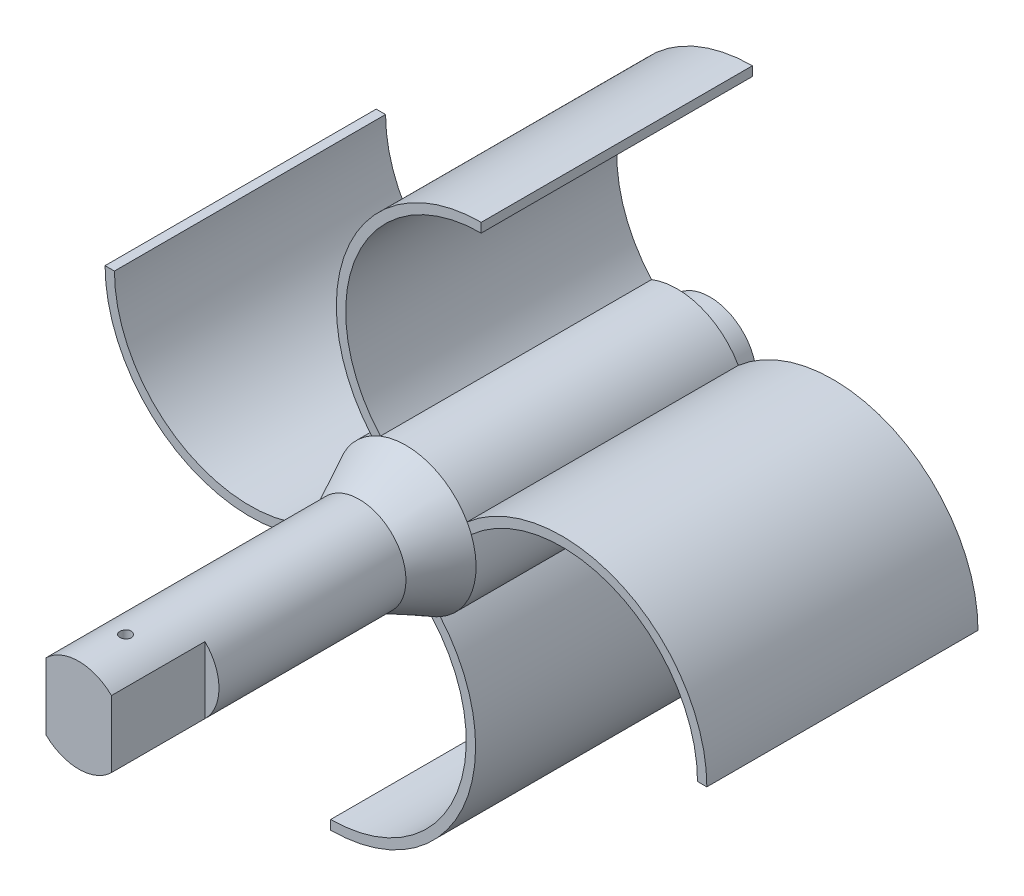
ISO-10303-21;
HEADER;
FILE_DESCRIPTION(('STEP AP214'),'2;1');
FILE_NAME('part.step','',(''),(''),'','','');
FILE_SCHEMA(('AUTOMOTIVE_DESIGN { 1 0 10303 214 1 1 1 1 }'));
ENDSEC;
DATA;
#1=APPLICATION_CONTEXT('core data for automotive mechanical design processes');
#2=APPLICATION_PROTOCOL_DEFINITION('international standard','automotive_design',2000,#1);
#3=PRODUCT_CONTEXT('',#1,'mechanical');
#4=PRODUCT('Part','Part','',(#3));
#5=PRODUCT_RELATED_PRODUCT_CATEGORY('part','',(#4));
#6=PRODUCT_DEFINITION_FORMATION('','',#4);
#7=PRODUCT_DEFINITION_CONTEXT('part definition',#1,'design');
#8=PRODUCT_DEFINITION('design','',#6,#7);
#9=PRODUCT_DEFINITION_SHAPE('','',#8);
#10=(LENGTH_UNIT() NAMED_UNIT(*) SI_UNIT(.MILLI.,.METRE.));
#11=(NAMED_UNIT(*) PLANE_ANGLE_UNIT() SI_UNIT($,.RADIAN.));
#12=(NAMED_UNIT(*) SI_UNIT($,.STERADIAN.) SOLID_ANGLE_UNIT());
#13=UNCERTAINTY_MEASURE_WITH_UNIT(LENGTH_MEASURE(1.E-05),#10,'distance_accuracy_value','');
#14=(GEOMETRIC_REPRESENTATION_CONTEXT(3) GLOBAL_UNCERTAINTY_ASSIGNED_CONTEXT((#13)) GLOBAL_UNIT_ASSIGNED_CONTEXT((#10,
#11,#12)) REPRESENTATION_CONTEXT('',''));
#15=CARTESIAN_POINT('',(0.,0.,0.));
#16=DIRECTION('',(0.,0.,1.));
#17=DIRECTION('',(1.,0.,0.));
#18=AXIS2_PLACEMENT_3D('',#15,#16,#17);
#19=CARTESIAN_POINT('',(0.,0.,128.));
#20=DIRECTION('',(0.,0.,-1.));
#21=DIRECTION('',(-1.,0.,0.));
#22=AXIS2_PLACEMENT_3D('',#19,#20,#21);
#23=CYLINDRICAL_SURFACE('',#22,10.);
#24=CARTESIAN_POINT('',(0.,10.,119.2));
#25=CARTESIAN_POINT('',(-0.0671456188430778,9.99999909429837,119.199997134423));
#26=CARTESIAN_POINT('',(-0.134333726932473,9.99931656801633,119.194345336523));
#27=CARTESIAN_POINT('',(-0.266841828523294,9.99665948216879,119.171887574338));
#28=CARTESIAN_POINT('',(-0.332159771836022,9.99468355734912,119.1550698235));
#29=CARTESIAN_POINT('',(-0.458989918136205,9.98966237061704,119.11078148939));
#30=CARTESIAN_POINT('',(-0.520504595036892,9.98661781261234,119.08331791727));
#31=CARTESIAN_POINT('',(-0.63803966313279,9.97979837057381,119.018532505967));
#32=CARTESIAN_POINT('',(-0.694061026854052,9.97602361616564,118.981212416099));
#33=CARTESIAN_POINT('',(-0.799316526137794,9.96814404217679,118.89757005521));
#34=CARTESIAN_POINT('',(-0.848518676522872,9.96403780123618,118.851207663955));
#35=CARTESIAN_POINT('',(-0.938463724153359,9.95596957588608,118.750882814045));
#36=CARTESIAN_POINT('',(-0.979206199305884,9.95200759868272,118.696919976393));
#37=CARTESIAN_POINT('',(-1.05119337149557,9.94466241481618,118.582719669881));
#38=CARTESIAN_POINT('',(-1.08240830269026,9.94128103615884,118.522463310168));
#39=CARTESIAN_POINT('',(-1.13426422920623,9.93549845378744,118.397516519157));
#40=CARTESIAN_POINT('',(-1.15490559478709,9.93309721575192,118.332826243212));
#41=CARTESIAN_POINT('',(-1.18493172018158,9.9295602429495,118.201178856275));
#42=CARTESIAN_POINT('',(-1.19437031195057,9.9284184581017,118.134234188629));
#43=CARTESIAN_POINT('',(-1.20188950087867,9.92751110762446,117.999702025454));
#44=CARTESIAN_POINT('',(-1.19997052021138,9.9277454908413,117.932114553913));
#45=CARTESIAN_POINT('',(-1.18487326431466,9.92955845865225,117.798589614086));
#46=CARTESIAN_POINT('',(-1.1717541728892,9.93112997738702,117.732645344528));
#47=CARTESIAN_POINT('',(-1.13472138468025,9.9354291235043,117.603901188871));
#48=CARTESIAN_POINT('',(-1.11080748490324,9.9381567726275,117.541101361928));
#49=CARTESIAN_POINT('',(-1.05279992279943,9.94446888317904,117.420244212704));
#50=CARTESIAN_POINT('',(-1.01868042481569,9.94805551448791,117.362199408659));
#51=CARTESIAN_POINT('',(-0.94124869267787,9.95567975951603,117.252637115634));
#52=CARTESIAN_POINT('',(-0.897936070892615,9.95971739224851,117.201119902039));
#53=CARTESIAN_POINT('',(-0.803019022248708,9.96782013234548,117.105731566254));
#54=CARTESIAN_POINT('',(-0.751363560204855,9.9718852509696,117.061911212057));
#55=CARTESIAN_POINT('',(-0.641403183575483,9.97956083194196,116.9835553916));
#56=CARTESIAN_POINT('',(-0.583098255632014,9.98317129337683,116.949019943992));
#57=CARTESIAN_POINT('',(-0.461455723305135,9.98953275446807,116.890214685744));
#58=CARTESIAN_POINT('',(-0.398116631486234,9.99228349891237,116.865947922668));
#59=CARTESIAN_POINT('',(-0.268222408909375,9.9966132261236,116.82840850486));
#60=CARTESIAN_POINT('',(-0.201667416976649,9.99819225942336,116.815135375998));
#61=CARTESIAN_POINT('',(-0.0676697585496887,9.99999410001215,116.800025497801));
#62=CARTESIAN_POINT('',(-0.000235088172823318,10.0002252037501,116.79811878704));
#63=CARTESIAN_POINT('',(0.1339928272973,9.99932751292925,116.805611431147));
#64=CARTESIAN_POINT('',(0.200786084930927,9.9981987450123,116.815010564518));
#65=CARTESIAN_POINT('',(0.331629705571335,9.99471333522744,116.844789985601));
#66=CARTESIAN_POINT('',(0.395687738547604,9.99236040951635,116.86513704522));
#67=CARTESIAN_POINT('',(0.519482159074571,9.9866902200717,116.916200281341));
#68=CARTESIAN_POINT('',(0.579218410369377,9.98337292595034,116.946916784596));
#69=CARTESIAN_POINT('',(0.692986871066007,9.97612340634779,117.018017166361));
#70=CARTESIAN_POINT('',(0.746990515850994,9.97218832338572,117.058446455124));
#71=CARTESIAN_POINT('',(0.847470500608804,9.96415271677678,117.147760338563));
#72=CARTESIAN_POINT('',(0.893946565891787,9.96005218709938,117.196645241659));
#73=CARTESIAN_POINT('',(0.978299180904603,9.95212237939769,117.301790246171));
#74=CARTESIAN_POINT('',(1.01612945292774,9.94829463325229,117.358087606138));
#75=CARTESIAN_POINT('',(1.08179725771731,9.94136859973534,117.47627801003));
#76=CARTESIAN_POINT('',(1.10963497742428,9.9382702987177,117.538170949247));
#77=CARTESIAN_POINT('',(1.15445198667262,9.9331642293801,117.665644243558));
#78=CARTESIAN_POINT('',(1.17145768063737,9.93115381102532,117.731215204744));
#79=CARTESIAN_POINT('',(1.19421308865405,9.92844341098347,117.864307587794));
#80=CARTESIAN_POINT('',(1.19996328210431,9.92774337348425,117.931828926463));
#81=CARTESIAN_POINT('',(1.20003613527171,9.92773453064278,118.066445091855));
#82=CARTESIAN_POINT('',(1.19443149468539,9.92841687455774,118.133539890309));
#83=CARTESIAN_POINT('',(1.17210739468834,9.93107691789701,118.265826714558));
#84=CARTESIAN_POINT('',(1.15538793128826,9.93305461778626,118.33101873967));
#85=CARTESIAN_POINT('',(1.11133095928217,9.93807986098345,118.457641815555));
#86=CARTESIAN_POINT('',(1.08399666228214,9.9411270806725,118.519073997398));
#87=CARTESIAN_POINT('',(1.01949313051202,9.94794858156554,118.636491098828));
#88=CARTESIAN_POINT('',(0.98232381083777,9.95172286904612,118.692475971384));
#89=CARTESIAN_POINT('',(0.898934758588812,9.9596022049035,118.797781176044));
#90=CARTESIAN_POINT('',(0.85266081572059,9.96370914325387,118.847058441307));
#91=CARTESIAN_POINT('',(0.752488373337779,9.97177419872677,118.937176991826));
#92=CARTESIAN_POINT('',(0.698588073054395,9.9757322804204,118.978016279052));
#93=CARTESIAN_POINT('',(0.58447728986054,9.98306886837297,119.0502202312));
#94=CARTESIAN_POINT('',(0.524245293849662,9.98644528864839,119.081551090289));
#95=CARTESIAN_POINT('',(0.399369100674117,9.99221674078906,119.133609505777));
#96=CARTESIAN_POINT('',(0.33472982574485,9.9946128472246,119.154348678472));
#97=CARTESIAN_POINT('',(0.224790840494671,9.99757073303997,119.179625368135));
#98=CARTESIAN_POINT('',(0.180186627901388,9.99847731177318,119.187254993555));
#99=CARTESIAN_POINT('',(0.0903946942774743,9.99969224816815,119.197443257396));
#100=CARTESIAN_POINT('',(0.0452069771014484,10.0000006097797,119.2000019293));
#101=CARTESIAN_POINT('',(0.,10.,119.2));
#102=B_SPLINE_CURVE_WITH_KNOTS('',3,(#24,#25,#26,#27,#28,#29,#30,#31,#32,#33,#34,#35,#36,#37,
#38,#39,#40,#41,#42,#43,#44,#45,#46,#47,#48,#49,#50,#51,#52,#53,#54,#55,#56,#57,#58,#59,#60,#61,
#62,#63,#64,#65,#66,#67,#68,#69,#70,#71,#72,#73,#74,#75,#76,#77,#78,#79,#80,#81,#82,#83,#84,#85,
#86,#87,#88,#89,#90,#91,#92,#93,#94,#95,#96,#97,#98,#99,#100,#101),.UNSPECIFIED.,.T.,.F.,(4,2,2,
2,2,2,2,2,2,2,2,2,2,2,2,2,2,2,2,2,2,2,2,2,2,2,2,2,2,2,2,2,2,2,2,2,2,2,4),(0.,0.201271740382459,
0.402756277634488,0.604108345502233,0.805424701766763,1.0076554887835,1.20989636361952,
1.41276275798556,1.61562204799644,1.81750255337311,2.0193755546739,2.22018837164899,
2.42100496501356,2.62233429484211,2.82367211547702,3.02629177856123,3.22891184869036,
3.43159201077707,3.63426343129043,3.83568609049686,4.03710480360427,4.23791561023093,
4.43873274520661,4.6405076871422,4.84228999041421,5.04512830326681,5.24796282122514,
5.45030099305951,5.65263054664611,5.8536687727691,6.05470707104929,6.25568459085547,
6.45666384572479,6.65887809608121,6.86114017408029,7.06411316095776,7.26686305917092,
7.40237371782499,7.53788348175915),.UNSPECIFIED.);
#103=CARTESIAN_POINT('',(0.,10.,119.2));
#104=VERTEX_POINT('',#103);
#105=EDGE_CURVE('E13',#104,#104,#102,.T.);
#106=ORIENTED_EDGE('',*,*,#105,.T.);
#107=EDGE_LOOP('',(#106));
#108=FACE_BOUND('',#107,.T.);
#109=CARTESIAN_POINT('',(0.,-10.,119.2));
#110=CARTESIAN_POINT('',(0.0671456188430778,-9.99999909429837,119.199997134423));
#111=CARTESIAN_POINT('',(0.134333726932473,-9.99931656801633,119.194345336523));
#112=CARTESIAN_POINT('',(0.266841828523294,-9.99665948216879,119.171887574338));
#113=CARTESIAN_POINT('',(0.332159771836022,-9.99468355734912,119.1550698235));
#114=CARTESIAN_POINT('',(0.458989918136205,-9.98966237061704,119.11078148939));
#115=CARTESIAN_POINT('',(0.520504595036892,-9.98661781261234,119.08331791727));
#116=CARTESIAN_POINT('',(0.63803966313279,-9.97979837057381,119.018532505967));
#117=CARTESIAN_POINT('',(0.694061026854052,-9.97602361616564,118.981212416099));
#118=CARTESIAN_POINT('',(0.799316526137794,-9.96814404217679,118.89757005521));
#119=CARTESIAN_POINT('',(0.848518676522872,-9.96403780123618,118.851207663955));
#120=CARTESIAN_POINT('',(0.938463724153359,-9.95596957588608,118.750882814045));
#121=CARTESIAN_POINT('',(0.979206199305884,-9.95200759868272,118.696919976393));
#122=CARTESIAN_POINT('',(1.05119337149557,-9.94466241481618,118.582719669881));
#123=CARTESIAN_POINT('',(1.08240830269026,-9.94128103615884,118.522463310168));
#124=CARTESIAN_POINT('',(1.13426422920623,-9.93549845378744,118.397516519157));
#125=CARTESIAN_POINT('',(1.15490559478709,-9.93309721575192,118.332826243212));
#126=CARTESIAN_POINT('',(1.18493172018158,-9.9295602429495,118.201178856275));
#127=CARTESIAN_POINT('',(1.19437031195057,-9.9284184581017,118.134234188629));
#128=CARTESIAN_POINT('',(1.20188950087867,-9.92751110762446,117.999702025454));
#129=CARTESIAN_POINT('',(1.19997052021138,-9.9277454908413,117.932114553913));
#130=CARTESIAN_POINT('',(1.18487326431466,-9.92955845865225,117.798589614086));
#131=CARTESIAN_POINT('',(1.1717541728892,-9.93112997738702,117.732645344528));
#132=CARTESIAN_POINT('',(1.13472138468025,-9.9354291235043,117.603901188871));
#133=CARTESIAN_POINT('',(1.11080748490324,-9.9381567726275,117.541101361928));
#134=CARTESIAN_POINT('',(1.05279992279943,-9.94446888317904,117.420244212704));
#135=CARTESIAN_POINT('',(1.01868042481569,-9.94805551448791,117.362199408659));
#136=CARTESIAN_POINT('',(0.94124869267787,-9.95567975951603,117.252637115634));
#137=CARTESIAN_POINT('',(0.897936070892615,-9.95971739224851,117.201119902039));
#138=CARTESIAN_POINT('',(0.803019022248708,-9.96782013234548,117.105731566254));
#139=CARTESIAN_POINT('',(0.751363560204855,-9.9718852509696,117.061911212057));
#140=CARTESIAN_POINT('',(0.641403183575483,-9.97956083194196,116.9835553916));
#141=CARTESIAN_POINT('',(0.583098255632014,-9.98317129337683,116.949019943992));
#142=CARTESIAN_POINT('',(0.461455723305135,-9.98953275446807,116.890214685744));
#143=CARTESIAN_POINT('',(0.398116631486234,-9.99228349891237,116.865947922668));
#144=CARTESIAN_POINT('',(0.268222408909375,-9.9966132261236,116.82840850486));
#145=CARTESIAN_POINT('',(0.201667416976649,-9.99819225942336,116.815135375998));
#146=CARTESIAN_POINT('',(0.0676697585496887,-9.99999410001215,116.800025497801));
#147=CARTESIAN_POINT('',(0.000235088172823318,-10.0002252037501,116.79811878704));
#148=CARTESIAN_POINT('',(-0.1339928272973,-9.99932751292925,116.805611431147));
#149=CARTESIAN_POINT('',(-0.200786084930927,-9.9981987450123,116.815010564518));
#150=CARTESIAN_POINT('',(-0.331629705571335,-9.99471333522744,116.844789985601));
#151=CARTESIAN_POINT('',(-0.395687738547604,-9.99236040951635,116.86513704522));
#152=CARTESIAN_POINT('',(-0.519482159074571,-9.9866902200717,116.916200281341));
#153=CARTESIAN_POINT('',(-0.579218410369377,-9.98337292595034,116.946916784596));
#154=CARTESIAN_POINT('',(-0.692986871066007,-9.97612340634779,117.018017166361));
#155=CARTESIAN_POINT('',(-0.746990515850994,-9.97218832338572,117.058446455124));
#156=CARTESIAN_POINT('',(-0.847470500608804,-9.96415271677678,117.147760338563));
#157=CARTESIAN_POINT('',(-0.893946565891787,-9.96005218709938,117.196645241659));
#158=CARTESIAN_POINT('',(-0.978299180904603,-9.95212237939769,117.301790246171));
#159=CARTESIAN_POINT('',(-1.01612945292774,-9.94829463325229,117.358087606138));
#160=CARTESIAN_POINT('',(-1.08179725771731,-9.94136859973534,117.47627801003));
#161=CARTESIAN_POINT('',(-1.10963497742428,-9.9382702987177,117.538170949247));
#162=CARTESIAN_POINT('',(-1.15445198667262,-9.9331642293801,117.665644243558));
#163=CARTESIAN_POINT('',(-1.17145768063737,-9.93115381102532,117.731215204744));
#164=CARTESIAN_POINT('',(-1.19421308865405,-9.92844341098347,117.864307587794));
#165=CARTESIAN_POINT('',(-1.19996328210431,-9.92774337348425,117.931828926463));
#166=CARTESIAN_POINT('',(-1.20003613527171,-9.92773453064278,118.066445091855));
#167=CARTESIAN_POINT('',(-1.19443149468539,-9.92841687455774,118.133539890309));
#168=CARTESIAN_POINT('',(-1.17210739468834,-9.93107691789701,118.265826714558));
#169=CARTESIAN_POINT('',(-1.15538793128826,-9.93305461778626,118.33101873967));
#170=CARTESIAN_POINT('',(-1.11133095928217,-9.93807986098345,118.457641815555));
#171=CARTESIAN_POINT('',(-1.08399666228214,-9.9411270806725,118.519073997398));
#172=CARTESIAN_POINT('',(-1.01949313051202,-9.94794858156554,118.636491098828));
#173=CARTESIAN_POINT('',(-0.98232381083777,-9.95172286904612,118.692475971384));
#174=CARTESIAN_POINT('',(-0.898934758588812,-9.9596022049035,118.797781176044));
#175=CARTESIAN_POINT('',(-0.85266081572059,-9.96370914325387,118.847058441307));
#176=CARTESIAN_POINT('',(-0.752488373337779,-9.97177419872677,118.937176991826));
#177=CARTESIAN_POINT('',(-0.698588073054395,-9.9757322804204,118.978016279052));
#178=CARTESIAN_POINT('',(-0.58447728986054,-9.98306886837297,119.0502202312));
#179=CARTESIAN_POINT('',(-0.524245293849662,-9.98644528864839,119.081551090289));
#180=CARTESIAN_POINT('',(-0.399369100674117,-9.99221674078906,119.133609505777));
#181=CARTESIAN_POINT('',(-0.33472982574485,-9.9946128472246,119.154348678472));
#182=CARTESIAN_POINT('',(-0.224790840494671,-9.99757073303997,119.179625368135));
#183=CARTESIAN_POINT('',(-0.180186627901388,-9.99847731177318,119.187254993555));
#184=CARTESIAN_POINT('',(-0.0903946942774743,-9.99969224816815,119.197443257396));
#185=CARTESIAN_POINT('',(-0.0452069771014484,-10.0000006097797,119.2000019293));
#186=CARTESIAN_POINT('',(0.,-10.,119.2));
#187=B_SPLINE_CURVE_WITH_KNOTS('',3,(#109,#110,#111,#112,#113,#114,#115,#116,#117,#118,#119,
#120,#121,#122,#123,#124,#125,#126,#127,#128,#129,#130,#131,#132,#133,#134,#135,#136,#137,#138,
#139,#140,#141,#142,#143,#144,#145,#146,#147,#148,#149,#150,#151,#152,#153,#154,#155,#156,#157,
#158,#159,#160,#161,#162,#163,#164,#165,#166,#167,#168,#169,#170,#171,#172,#173,#174,#175,#176,
#177,#178,#179,#180,#181,#182,#183,#184,#185,#186),.UNSPECIFIED.,.T.,.F.,(4,2,2,2,2,2,2,2,2,2,2,
2,2,2,2,2,2,2,2,2,2,2,2,2,2,2,2,2,2,2,2,2,2,2,2,2,2,2,4),(0.,0.201271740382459,
0.402756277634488,0.604108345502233,0.805424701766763,1.0076554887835,1.20989636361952,
1.41276275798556,1.61562204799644,1.81750255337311,2.0193755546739,2.22018837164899,
2.42100496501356,2.62233429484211,2.82367211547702,3.02629177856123,3.22891184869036,
3.43159201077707,3.63426343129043,3.83568609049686,4.03710480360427,4.23791561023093,
4.43873274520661,4.6405076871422,4.84228999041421,5.04512830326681,5.24796282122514,
5.45030099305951,5.65263054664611,5.8536687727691,6.05470707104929,6.25568459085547,
6.45666384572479,6.65887809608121,6.86114017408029,7.06411316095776,7.26686305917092,
7.40237371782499,7.53788348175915),.UNSPECIFIED.);
#188=CARTESIAN_POINT('',(0.,-10.,119.2));
#189=VERTEX_POINT('',#188);
#190=EDGE_CURVE('E269',#189,#189,#187,.T.);
#191=ORIENTED_EDGE('',*,*,#190,.T.);
#192=EDGE_LOOP('',(#191));
#193=FACE_BOUND('',#192,.T.);
#194=CARTESIAN_POINT('',(0.,0.,68.));
#195=DIRECTION('',(0.,0.,1.));
#196=DIRECTION('',(1.,0.,0.));
#197=AXIS2_PLACEMENT_3D('',#194,#195,#196);
#198=CIRCLE('',#197,10.);
#199=CARTESIAN_POINT('',(10.,0.,68.));
#200=VERTEX_POINT('',#199);
#201=EDGE_CURVE('E195',#200,#200,#198,.T.);
#202=ORIENTED_EDGE('',*,*,#201,.T.);
#203=EDGE_LOOP('',(#202));
#204=FACE_BOUND('',#203,.T.);
#205=DIRECTION('',(0.,0.,-1.));
#206=VECTOR('',#205,1.);
#207=CARTESIAN_POINT('',(7.,-7.14142842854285,128.));
#208=LINE('',#207,#206);
#209=CARTESIAN_POINT('',(7.,-7.14142842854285,128.));
#210=VERTEX_POINT('',#209);
#211=CARTESIAN_POINT('',(7.,-7.14142842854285,108.));
#212=VERTEX_POINT('',#211);
#213=EDGE_CURVE('E201',#210,#212,#208,.T.);
#214=ORIENTED_EDGE('',*,*,#213,.F.);
#215=CARTESIAN_POINT('',(0.,0.,128.));
#216=DIRECTION('',(0.,0.,1.));
#217=DIRECTION('',(1.,0.,0.));
#218=AXIS2_PLACEMENT_3D('',#215,#216,#217);
#219=CIRCLE('',#218,10.);
#220=CARTESIAN_POINT('',(-7.,-7.14142842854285,128.));
#221=VERTEX_POINT('',#220);
#222=EDGE_CURVE('E196',#221,#210,#219,.T.);
#223=ORIENTED_EDGE('',*,*,#222,.F.);
#224=DIRECTION('',(0.,0.,-1.));
#225=VECTOR('',#224,1.);
#226=CARTESIAN_POINT('',(-7.,-7.14142842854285,128.));
#227=LINE('',#226,#225);
#228=CARTESIAN_POINT('',(-7.,-7.14142842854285,108.));
#229=VERTEX_POINT('',#228);
#230=EDGE_CURVE('E54',#229,#221,#227,.F.);
#231=ORIENTED_EDGE('',*,*,#230,.F.);
#232=CARTESIAN_POINT('',(0.,0.,108.));
#233=DIRECTION('',(0.,0.,1.));
#234=DIRECTION('',(1.,0.,0.));
#235=AXIS2_PLACEMENT_3D('',#232,#233,#234);
#236=CIRCLE('',#235,10.);
#237=CARTESIAN_POINT('',(-7.,7.14142842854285,108.));
#238=VERTEX_POINT('',#237);
#239=EDGE_CURVE('E192',#238,#229,#236,.T.);
#240=ORIENTED_EDGE('',*,*,#239,.F.);
#241=DIRECTION('',(0.,0.,-1.));
#242=VECTOR('',#241,1.);
#243=CARTESIAN_POINT('',(-7.,7.14142842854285,128.));
#244=LINE('',#243,#242);
#245=CARTESIAN_POINT('',(-7.,7.14142842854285,128.));
#246=VERTEX_POINT('',#245);
#247=EDGE_CURVE('E178',#246,#238,#244,.T.);
#248=ORIENTED_EDGE('',*,*,#247,.F.);
#249=CARTESIAN_POINT('',(7.,7.14142842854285,128.));
#250=VERTEX_POINT('',#249);
#251=EDGE_CURVE('E191',#250,#246,#219,.T.);
#252=ORIENTED_EDGE('',*,*,#251,.F.);
#253=DIRECTION('',(0.,0.,-1.));
#254=VECTOR('',#253,1.);
#255=CARTESIAN_POINT('',(7.,7.14142842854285,128.));
#256=LINE('',#255,#254);
#257=CARTESIAN_POINT('',(7.,7.14142842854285,108.));
#258=VERTEX_POINT('',#257);
#259=EDGE_CURVE('E62',#258,#250,#256,.F.);
#260=ORIENTED_EDGE('',*,*,#259,.F.);
#261=EDGE_CURVE('E47',#212,#258,#236,.T.);
#262=ORIENTED_EDGE('',*,*,#261,.F.);
#263=EDGE_LOOP('',(#214,#223,#231,#240,#248,#252,#260,#262));
#264=FACE_BOUND('',#263,.T.);
#265=ADVANCED_FACE('F34',(#108,#193,#204,#264),#23,.T.);
#266=CARTESIAN_POINT('',(0.,0.,128.));
#267=DIRECTION('',(0.,0.,1.));
#268=DIRECTION('',(1.,0.,0.));
#269=AXIS2_PLACEMENT_3D('',#266,#267,#268);
#270=PLANE('',#269);
#271=ORIENTED_EDGE('',*,*,#222,.T.);
#272=DIRECTION('',(0.,1.,0.));
#273=VECTOR('',#272,1.);
#274=CARTESIAN_POINT('',(7.,0.,128.));
#275=LINE('',#274,#273);
#276=EDGE_CURVE('E184',#210,#250,#275,.T.);
#277=ORIENTED_EDGE('',*,*,#276,.T.);
#278=ORIENTED_EDGE('',*,*,#251,.T.);
#279=DIRECTION('',(0.,-1.,0.));
#280=VECTOR('',#279,1.);
#281=CARTESIAN_POINT('',(-7.,0.,128.));
#282=LINE('',#281,#280);
#283=EDGE_CURVE('E175',#246,#221,#282,.T.);
#284=ORIENTED_EDGE('',*,*,#283,.T.);
#285=EDGE_LOOP('',(#271,#277,#278,#284));
#286=FACE_BOUND('',#285,.T.);
#287=ADVANCED_FACE('F194',(#286),#270,.T.);
#288=CARTESIAN_POINT('',(0.,0.,58.));
#289=DIRECTION('',(0.,0.,1.));
#290=DIRECTION('',(1.,0.,0.));
#291=AXIS2_PLACEMENT_3D('',#288,#289,#290);
#292=PLANE('',#291);
#293=CARTESIAN_POINT('',(-16.1026338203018,-33.3633349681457,58.));
#294=DIRECTION('',(0.,0.,1.));
#295=DIRECTION('',(1.,0.,0.));
#296=AXIS2_PLACEMENT_3D('',#293,#294,#295);
#297=CIRCLE('',#296,31.);
#298=CARTESIAN_POINT('',(-16.1026338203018,-64.3633349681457,58.));
#299=VERTEX_POINT('',#298);
#300=CARTESIAN_POINT('',(7.34126581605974,-13.0807421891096,58.));
#301=VERTEX_POINT('',#300);
#302=EDGE_CURVE('E614',#299,#301,#297,.T.);
#303=ORIENTED_EDGE('',*,*,#302,.T.);
#304=CARTESIAN_POINT('',(7.34126560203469,-13.0807418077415,58.));
#305=CARTESIAN_POINT('',(7.30340291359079,-13.1019906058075,58.));
#306=CARTESIAN_POINT('',(7.26544781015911,-13.1230749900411,58.));
#307=CARTESIAN_POINT('',(7.18933207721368,-13.1649274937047,58.));
#308=CARTESIAN_POINT('',(7.15117133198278,-13.1856954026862,58.));
#309=CARTESIAN_POINT('',(7.09894333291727,-13.2138270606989,58.));
#310=CARTESIAN_POINT('',(7.08495314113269,-13.2213341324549,58.));
#311=CARTESIAN_POINT('',(7.04668687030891,-13.2417894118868,58.));
#312=CARTESIAN_POINT('',(7.02238696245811,-13.2546930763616,58.));
#313=CARTESIAN_POINT('',(6.95969995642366,-13.287759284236,58.));
#314=CARTESIAN_POINT('',(6.92126021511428,-13.3078221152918,58.));
#315=CARTESIAN_POINT('',(6.84419099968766,-13.3476217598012,58.));
#316=CARTESIAN_POINT('',(6.80556144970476,-13.3673584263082,58.));
#317=CARTESIAN_POINT('',(6.72811256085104,-13.4065057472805,58.));
#318=CARTESIAN_POINT('',(6.68929313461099,-13.4259162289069,58.));
#319=CARTESIAN_POINT('',(6.61146446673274,-13.4644110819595,58.));
#320=CARTESIAN_POINT('',(6.5724551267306,-13.4834952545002,58.));
#321=CARTESIAN_POINT('',(6.49343637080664,-13.521730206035,58.));
#322=CARTESIAN_POINT('',(6.45342341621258,-13.5408736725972,58.));
#323=CARTESIAN_POINT('',(6.37495103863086,-13.5779907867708,58.));
#324=CARTESIAN_POINT('',(6.33649867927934,-13.5959793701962,58.));
#325=CARTESIAN_POINT('',(6.25861193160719,-13.6320121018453,58.));
#326=CARTESIAN_POINT('',(6.21917423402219,-13.6500490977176,58.));
#327=CARTESIAN_POINT('',(6.14012532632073,-13.6857882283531,58.));
#328=CARTESIAN_POINT('',(6.10051404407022,-13.703490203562,58.));
#329=CARTESIAN_POINT('',(6.02111792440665,-13.7385591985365,58.));
#330=CARTESIAN_POINT('',(5.98133300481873,-13.7559260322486,58.));
#331=CARTESIAN_POINT('',(5.90158957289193,-13.7903247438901,58.));
#332=CARTESIAN_POINT('',(5.86163096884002,-13.8073564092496,58.));
#333=CARTESIAN_POINT('',(5.79451671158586,-13.8356203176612,58.));
#334=CARTESIAN_POINT('',(5.76740057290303,-13.8469464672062,58.));
#335=CARTESIAN_POINT('',(5.72728303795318,-13.8635651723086,58.));
#336=CARTESIAN_POINT('',(5.71430707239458,-13.8689191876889,58.));
#337=CARTESIAN_POINT('',(5.66122310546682,-13.890734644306,58.));
#338=CARTESIAN_POINT('',(5.62105074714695,-13.9070398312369,58.));
#339=CARTESIAN_POINT('',(5.54054910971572,-13.9393071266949,58.));
#340=CARTESIAN_POINT('',(5.50021977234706,-13.9552690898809,58.));
#341=CARTESIAN_POINT('',(5.45982206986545,-13.9710556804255,58.));
#342=B_SPLINE_CURVE_WITH_KNOTS('',3,(#304,#305,#306,#307,#308,#309,#310,#311,#312,#313,#314,
#315,#316,#317,#318,#319,#320,#321,#322,#323,#324,#325,#326,#327,#328,#329,#330,#331,#332,#333,
#334,#335,#336,#337,#338,#339,#340,#341),.UNSPECIFIED.,.F.,.F.,(4,2,2,2,2,2,2,2,2,2,2,2,2,2,2,2,
2,2,4),(0.,0.130252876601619,0.260588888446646,0.308220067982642,0.390760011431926,
0.520839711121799,0.650976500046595,0.781180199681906,0.911460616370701,1.04452869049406,
1.17188319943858,1.30198146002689,1.43214019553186,1.56236922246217,1.69267834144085,
1.78083734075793,1.82294871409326,1.95301266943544,2.0831306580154),.UNSPECIFIED.);
#343=CARTESIAN_POINT('',(5.45982078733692,-13.9710542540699,58.));
#344=VERTEX_POINT('',#343);
#345=EDGE_CURVE('E185',#301,#344,#342,.T.);
#346=ORIENTED_EDGE('',*,*,#345,.T.);
#347=CARTESIAN_POINT('',(-16.1026338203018,-33.3633349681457,58.));
#348=DIRECTION('',(0.,0.,-1.));
#349=DIRECTION('',(1.,0.,0.));
#350=AXIS2_PLACEMENT_3D('',#347,#348,#349);
#351=CIRCLE('',#350,29.);
#352=CARTESIAN_POINT('',(-16.1026338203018,-62.3633349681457,58.));
#353=VERTEX_POINT('',#352);
#354=EDGE_CURVE('E632',#344,#353,#351,.T.);
#355=ORIENTED_EDGE('',*,*,#354,.T.);
#356=DIRECTION('',(0.,-1.,0.));
#357=VECTOR('',#356,1.);
#358=CARTESIAN_POINT('',(-16.1026338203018,-64.3633349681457,58.));
#359=LINE('',#358,#357);
#360=EDGE_CURVE('E617',#353,#299,#359,.T.);
#361=ORIENTED_EDGE('',*,*,#360,.T.);
#362=EDGE_LOOP('',(#303,#346,#355,#361));
#363=FACE_BOUND('',#362,.T.);
#364=ADVANCED_FACE('F290',(#363),#292,.T.);
#365=CARTESIAN_POINT('',(-33.3633349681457,16.1026338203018,58.));
#366=DIRECTION('',(0.,0.,1.));
#367=DIRECTION('',(1.,0.,0.));
#368=AXIS2_PLACEMENT_3D('',#365,#366,#367);
#369=CIRCLE('',#368,31.);
#370=CARTESIAN_POINT('',(-64.3633349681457,16.1026338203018,58.));
#371=VERTEX_POINT('',#370);
#372=CARTESIAN_POINT('',(-13.0807421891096,-7.34126581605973,58.));
#373=VERTEX_POINT('',#372);
#374=EDGE_CURVE('E587',#371,#373,#369,.T.);
#375=ORIENTED_EDGE('',*,*,#374,.T.);
#376=CARTESIAN_POINT('',(-13.0807418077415,-7.34126560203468,58.));
#377=CARTESIAN_POINT('',(-13.1019906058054,-7.30340291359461,58.));
#378=CARTESIAN_POINT('',(-13.1230749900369,-7.26544781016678,58.));
#379=CARTESIAN_POINT('',(-13.1649274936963,-7.18933207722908,58.));
#380=CARTESIAN_POINT('',(-13.1856954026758,-7.15117133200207,58.));
#381=CARTESIAN_POINT('',(-13.2138270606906,-7.09894333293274,58.));
#382=CARTESIAN_POINT('',(-13.2213341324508,-7.08495314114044,58.));
#383=CARTESIAN_POINT('',(-13.2417894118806,-7.0466868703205,58.));
#384=CARTESIAN_POINT('',(-13.2546930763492,-7.02238696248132,58.));
#385=CARTESIAN_POINT('',(-13.2877592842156,-6.95969995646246,58.));
#386=CARTESIAN_POINT('',(-13.3078221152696,-6.92126021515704,58.));
#387=CARTESIAN_POINT('',(-13.3476217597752,-6.84419099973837,58.));
#388=CARTESIAN_POINT('',(-13.3673584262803,-6.80556144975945,58.));
#389=CARTESIAN_POINT('',(-13.406505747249,-6.72811256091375,58.));
#390=CARTESIAN_POINT('',(-13.4259162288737,-6.68929313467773,58.));
#391=CARTESIAN_POINT('',(-13.4644110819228,-6.61146446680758,58.));
#392=CARTESIAN_POINT('',(-13.4834952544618,-6.5724551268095,58.));
#393=CARTESIAN_POINT('',(-13.5217302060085,-6.49343637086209,58.));
#394=CARTESIAN_POINT('',(-13.5408736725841,-6.45342341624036,58.));
#395=CARTESIAN_POINT('',(-13.5779907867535,-6.37495103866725,58.));
#396=CARTESIAN_POINT('',(-13.595979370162,-6.33649867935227,58.));
#397=CARTESIAN_POINT('',(-13.6320121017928,-6.25861193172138,58.));
#398=CARTESIAN_POINT('',(-13.6500490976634,-6.21917423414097,58.));
#399=CARTESIAN_POINT('',(-13.6857882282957,-6.1401253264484,58.));
#400=CARTESIAN_POINT('',(-13.7034902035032,-6.10051404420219,58.));
#401=CARTESIAN_POINT('',(-13.7385591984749,-6.02111792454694,58.));
#402=CARTESIAN_POINT('',(-13.7559260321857,-5.98133300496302,58.));
#403=CARTESIAN_POINT('',(-13.7903247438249,-5.90158957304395,58.));
#404=CARTESIAN_POINT('',(-13.8073564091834,-5.86163096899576,58.));
#405=CARTESIAN_POINT('',(-13.8356203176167,-5.7945167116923,58.));
#406=CARTESIAN_POINT('',(-13.8469464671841,-5.76740057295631,58.));
#407=CARTESIAN_POINT('',(-13.863565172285,-5.72728303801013,58.));
#408=CARTESIAN_POINT('',(-13.8689191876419,-5.71430707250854,58.));
#409=CARTESIAN_POINT('',(-13.8907346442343,-5.66122310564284,58.));
#410=CARTESIAN_POINT('',(-13.9070398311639,-5.62105074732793,58.));
#411=CARTESIAN_POINT('',(-13.9393071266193,-5.54054910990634,58.));
#412=CARTESIAN_POINT('',(-13.955269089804,-5.50021977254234,58.));
#413=CARTESIAN_POINT('',(-13.9710556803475,-5.4598220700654,58.));
#414=B_SPLINE_CURVE_WITH_KNOTS('',3,(#376,#377,#378,#379,#380,#381,#382,#383,#384,#385,#386,
#387,#388,#389,#390,#391,#392,#393,#394,#395,#396,#397,#398,#399,#400,#401,#402,#403,#404,#405,
#406,#407,#408,#409,#410,#411,#412,#413),.UNSPECIFIED.,.F.,.F.,(4,2,2,2,2,2,2,2,2,2,2,2,2,2,2,2,
2,2,4),(0.,0.130252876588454,0.260588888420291,0.308220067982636,0.390760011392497,
0.520839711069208,0.650976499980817,0.781180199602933,0.91146061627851,1.04452869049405,
1.17188319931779,1.30198145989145,1.43214019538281,1.56236922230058,1.69267834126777,
1.78083734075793,1.82294871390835,1.95301266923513,2.08313065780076),.UNSPECIFIED.);
#415=CARTESIAN_POINT('',(-13.9710542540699,-5.45982078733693,58.));
#416=VERTEX_POINT('',#415);
#417=EDGE_CURVE('E583',#373,#416,#414,.T.);
#418=ORIENTED_EDGE('',*,*,#417,.T.);
#419=CARTESIAN_POINT('',(-33.3633349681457,16.1026338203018,58.));
#420=DIRECTION('',(0.,0.,-1.));
#421=DIRECTION('',(1.,0.,0.));
#422=AXIS2_PLACEMENT_3D('',#419,#420,#421);
#423=CIRCLE('',#422,29.);
#424=CARTESIAN_POINT('',(-62.3633349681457,16.1026338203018,58.));
#425=VERTEX_POINT('',#424);
#426=EDGE_CURVE('E600',#416,#425,#423,.T.);
#427=ORIENTED_EDGE('',*,*,#426,.T.);
#428=DIRECTION('',(-1.,0.,0.));
#429=VECTOR('',#428,1.);
#430=CARTESIAN_POINT('',(-64.3633349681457,16.1026338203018,58.));
#431=LINE('',#430,#429);
#432=EDGE_CURVE('E590',#425,#371,#431,.T.);
#433=ORIENTED_EDGE('',*,*,#432,.T.);
#434=EDGE_LOOP('',(#375,#418,#427,#433));
#435=FACE_BOUND('',#434,.T.);
#436=ADVANCED_FACE('F295',(#435),#292,.T.);
#437=CARTESIAN_POINT('',(16.1026338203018,33.3633349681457,58.));
#438=DIRECTION('',(0.,0.,1.));
#439=DIRECTION('',(1.,0.,0.));
#440=AXIS2_PLACEMENT_3D('',#437,#438,#439);
#441=CIRCLE('',#440,31.);
#442=CARTESIAN_POINT('',(16.1026338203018,64.3633349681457,58.));
#443=VERTEX_POINT('',#442);
#444=CARTESIAN_POINT('',(-7.34126581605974,13.0807421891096,58.));
#445=VERTEX_POINT('',#444);
#446=EDGE_CURVE('E689',#443,#445,#441,.T.);
#447=ORIENTED_EDGE('',*,*,#446,.T.);
#448=CARTESIAN_POINT('',(-7.34126560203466,13.0807418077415,58.));
#449=CARTESIAN_POINT('',(-7.30340291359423,13.1019906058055,58.));
#450=CARTESIAN_POINT('',(-7.26544781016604,13.1230749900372,58.));
#451=CARTESIAN_POINT('',(-7.18933207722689,13.1649274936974,58.));
#452=CARTESIAN_POINT('',(-7.15117133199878,13.1856954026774,58.));
#453=CARTESIAN_POINT('',(-7.09894333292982,13.2138270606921,58.));
#454=CARTESIAN_POINT('',(-7.08495314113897,13.2213341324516,58.));
#455=CARTESIAN_POINT('',(-7.0466868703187,13.2417894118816,58.));
#456=CARTESIAN_POINT('',(-7.02238696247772,13.2546930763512,58.));
#457=CARTESIAN_POINT('',(-6.95969995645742,13.2877592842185,58.));
#458=CARTESIAN_POINT('',(-6.92126021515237,13.3078221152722,58.));
#459=CARTESIAN_POINT('',(-6.84419099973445,13.3476217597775,58.));
#460=CARTESIAN_POINT('',(-6.80556144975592,13.3673584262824,58.));
#461=CARTESIAN_POINT('',(-6.72811256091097,13.4065057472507,58.));
#462=CARTESIAN_POINT('',(-6.68929313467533,13.4259162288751,58.));
#463=CARTESIAN_POINT('',(-6.61146446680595,13.4644110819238,58.));
#464=CARTESIAN_POINT('',(-6.57245512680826,13.4834952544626,58.));
#465=CARTESIAN_POINT('',(-6.49343637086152,13.5217302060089,58.));
#466=CARTESIAN_POINT('',(-6.45342341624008,13.5408736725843,58.));
#467=CARTESIAN_POINT('',(-6.37495103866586,13.5779907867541,58.));
#468=CARTESIAN_POINT('',(-6.33649867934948,13.5959793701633,58.));
#469=CARTESIAN_POINT('',(-6.25861193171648,13.6320121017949,58.));
#470=CARTESIAN_POINT('',(-6.21917423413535,13.6500490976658,58.));
#471=CARTESIAN_POINT('',(-6.14012532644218,13.6857882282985,58.));
#472=CARTESIAN_POINT('',(-6.10051404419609,13.7034902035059,58.));
#473=CARTESIAN_POINT('',(-6.02111792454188,13.7385591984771,58.));
#474=CARTESIAN_POINT('',(-5.9813330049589,13.7559260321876,58.));
#475=CARTESIAN_POINT('',(-5.90158957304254,13.7903247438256,58.));
#476=CARTESIAN_POINT('',(-5.86163096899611,13.8073564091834,58.));
#477=CARTESIAN_POINT('',(-5.79451671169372,13.8356203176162,58.));
#478=CARTESIAN_POINT('',(-5.76740057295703,13.8469464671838,58.));
#479=CARTESIAN_POINT('',(-5.72728303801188,13.8635651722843,58.));
#480=CARTESIAN_POINT('',(-5.71430707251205,13.8689191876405,58.));
#481=CARTESIAN_POINT('',(-5.66122310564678,13.8907346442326,58.));
#482=CARTESIAN_POINT('',(-5.62105074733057,13.9070398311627,58.));
#483=CARTESIAN_POINT('',(-5.54054910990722,13.9393071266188,58.));
#484=CARTESIAN_POINT('',(-5.50021977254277,13.9552690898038,58.));
#485=CARTESIAN_POINT('',(-5.45982207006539,13.9710556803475,58.));
#486=B_SPLINE_CURVE_WITH_KNOTS('',3,(#448,#449,#450,#451,#452,#453,#454,#455,#456,#457,#458,
#459,#460,#461,#462,#463,#464,#465,#466,#467,#468,#469,#470,#471,#472,#473,#474,#475,#476,#477,
#478,#479,#480,#481,#482,#483,#484,#485),.UNSPECIFIED.,.F.,.F.,(4,2,2,2,2,2,2,2,2,2,2,2,2,2,2,2,
2,2,4),(0.,0.130252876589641,0.260588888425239,0.30822006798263,0.390760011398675,
0.520839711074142,0.650976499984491,0.781180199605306,0.911460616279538,1.04452869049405,
1.17188319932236,1.30198145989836,1.43214019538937,1.56236922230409,1.69267834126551,
1.78083734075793,1.82294871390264,1.95301266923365,2.08313065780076),.UNSPECIFIED.);
#487=CARTESIAN_POINT('',(-5.45982078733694,13.9710542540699,58.));
#488=VERTEX_POINT('',#487);
#489=EDGE_CURVE('E669',#445,#488,#486,.T.);
#490=ORIENTED_EDGE('',*,*,#489,.T.);
#491=CARTESIAN_POINT('',(16.1026338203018,33.3633349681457,58.));
#492=DIRECTION('',(0.,0.,-1.));
#493=DIRECTION('',(1.,0.,0.));
#494=AXIS2_PLACEMENT_3D('',#491,#492,#493);
#495=CIRCLE('',#494,29.);
#496=CARTESIAN_POINT('',(16.1026338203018,62.3633349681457,58.));
#497=VERTEX_POINT('',#496);
#498=EDGE_CURVE('E254',#488,#497,#495,.T.);
#499=ORIENTED_EDGE('',*,*,#498,.T.);
#500=DIRECTION('',(0.,1.,0.));
#501=VECTOR('',#500,1.);
#502=CARTESIAN_POINT('',(16.1026338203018,64.3633349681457,58.));
#503=LINE('',#502,#501);
#504=EDGE_CURVE('E687',#497,#443,#503,.T.);
#505=ORIENTED_EDGE('',*,*,#504,.T.);
#506=EDGE_LOOP('',(#447,#490,#499,#505));
#507=FACE_BOUND('',#506,.T.);
#508=ADVANCED_FACE('F490',(#507),#292,.T.);
#509=CARTESIAN_POINT('',(33.3633349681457,-16.1026338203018,58.));
#510=DIRECTION('',(0.,0.,1.));
#511=DIRECTION('',(1.,0.,0.));
#512=AXIS2_PLACEMENT_3D('',#509,#510,#511);
#513=CIRCLE('',#512,31.);
#514=CARTESIAN_POINT('',(64.3633349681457,-16.1026338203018,58.));
#515=VERTEX_POINT('',#514);
#516=CARTESIAN_POINT('',(13.0807421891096,7.34126581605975,58.));
#517=VERTEX_POINT('',#516);
#518=EDGE_CURVE('E255',#515,#517,#513,.T.);
#519=ORIENTED_EDGE('',*,*,#518,.T.);
#520=CARTESIAN_POINT('',(0.,0.,58.));
#521=DIRECTION('',(0.,0.,1.));
#522=DIRECTION('',(1.,0.,0.));
#523=AXIS2_PLACEMENT_3D('',#520,#521,#522);
#524=CIRCLE('',#523,15.);
#525=CARTESIAN_POINT('',(13.9710550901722,5.45982111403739,58.));
#526=VERTEX_POINT('',#525);
#527=EDGE_CURVE('E199',#526,#517,#524,.T.);
#528=ORIENTED_EDGE('',*,*,#527,.F.);
#529=CARTESIAN_POINT('',(33.3633349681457,-16.1026338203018,58.));
#530=DIRECTION('',(0.,0.,-1.));
#531=DIRECTION('',(1.,0.,0.));
#532=AXIS2_PLACEMENT_3D('',#529,#530,#531);
#533=CIRCLE('',#532,29.);
#534=CARTESIAN_POINT('',(62.3633349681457,-16.1026338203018,58.));
#535=VERTEX_POINT('',#534);
#536=EDGE_CURVE('E686',#526,#535,#533,.T.);
#537=ORIENTED_EDGE('',*,*,#536,.T.);
#538=DIRECTION('',(1.,0.,0.));
#539=VECTOR('',#538,1.);
#540=CARTESIAN_POINT('',(64.3633349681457,-16.1026338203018,58.));
#541=LINE('',#540,#539);
#542=EDGE_CURVE('E684',#535,#515,#541,.T.);
#543=ORIENTED_EDGE('',*,*,#542,.T.);
#544=EDGE_LOOP('',(#519,#528,#537,#543));
#545=FACE_BOUND('',#544,.T.);
#546=ADVANCED_FACE('F298',(#545),#292,.T.);
#547=CARTESIAN_POINT('',(0.,0.,0.));
#548=DIRECTION('',(0.,0.,1.));
#549=DIRECTION('',(1.,0.,0.));
#550=AXIS2_PLACEMENT_3D('',#547,#548,#549);
#551=PLANE('',#550);
#552=CARTESIAN_POINT('',(0.,0.,0.));
#553=DIRECTION('',(0.,0.,1.));
#554=DIRECTION('',(1.,0.,0.));
#555=AXIS2_PLACEMENT_3D('',#552,#553,#554);
#556=CIRCLE('',#555,15.);
#557=CARTESIAN_POINT('',(-7.34126581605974,13.0807421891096,0.));
#558=VERTEX_POINT('',#557);
#559=CARTESIAN_POINT('',(-13.9710542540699,-5.45982078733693,0.));
#560=VERTEX_POINT('',#559);
#561=EDGE_CURVE('E681',#558,#560,#556,.T.);
#562=ORIENTED_EDGE('',*,*,#561,.F.);
#563=CARTESIAN_POINT('',(16.1026338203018,33.3633349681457,0.));
#564=DIRECTION('',(0.,0.,1.));
#565=DIRECTION('',(1.,0.,0.));
#566=AXIS2_PLACEMENT_3D('',#563,#564,#565);
#567=CIRCLE('',#566,31.);
#568=CARTESIAN_POINT('',(16.1026338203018,64.3633349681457,0.));
#569=VERTEX_POINT('',#568);
#570=EDGE_CURVE('E668',#569,#558,#567,.T.);
#571=ORIENTED_EDGE('',*,*,#570,.F.);
#572=DIRECTION('',(0.,1.,0.));
#573=VECTOR('',#572,1.);
#574=CARTESIAN_POINT('',(16.1026338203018,64.3633349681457,0.));
#575=LINE('',#574,#573);
#576=CARTESIAN_POINT('',(16.1026338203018,62.3633349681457,0.));
#577=VERTEX_POINT('',#576);
#578=EDGE_CURVE('E717',#577,#569,#575,.T.);
#579=ORIENTED_EDGE('',*,*,#578,.F.);
#580=CARTESIAN_POINT('',(16.1026338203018,33.3633349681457,0.));
#581=DIRECTION('',(0.,0.,-1.));
#582=DIRECTION('',(1.,0.,0.));
#583=AXIS2_PLACEMENT_3D('',#580,#581,#582);
#584=CIRCLE('',#583,29.);
#585=CARTESIAN_POINT('',(-5.45982078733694,13.9710542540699,0.));
#586=VERTEX_POINT('',#585);
#587=EDGE_CURVE('E715',#586,#577,#584,.T.);
#588=ORIENTED_EDGE('',*,*,#587,.F.);
#589=CARTESIAN_POINT('',(0.,0.,0.));
#590=DIRECTION('',(0.,0.,1.));
#591=DIRECTION('',(1.,0.,0.));
#592=AXIS2_PLACEMENT_3D('',#589,#590,#591);
#593=CIRCLE('',#592,15.);
#594=CARTESIAN_POINT('',(13.0807421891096,7.34126581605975,0.));
#595=VERTEX_POINT('',#594);
#596=EDGE_CURVE('E713',#595,#586,#593,.T.);
#597=ORIENTED_EDGE('',*,*,#596,.F.);
#598=CARTESIAN_POINT('',(33.3633349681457,-16.1026338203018,0.));
#599=DIRECTION('',(0.,0.,1.));
#600=DIRECTION('',(1.,0.,0.));
#601=AXIS2_PLACEMENT_3D('',#598,#599,#600);
#602=CIRCLE('',#601,31.);
#603=CARTESIAN_POINT('',(64.3633349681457,-16.1026338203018,0.));
#604=VERTEX_POINT('',#603);
#605=EDGE_CURVE('E711',#604,#595,#602,.T.);
#606=ORIENTED_EDGE('',*,*,#605,.F.);
#607=DIRECTION('',(1.,0.,0.));
#608=VECTOR('',#607,1.);
#609=CARTESIAN_POINT('',(64.3633349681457,-16.1026338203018,0.));
#610=LINE('',#609,#608);
#611=CARTESIAN_POINT('',(62.3633349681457,-16.1026338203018,0.));
#612=VERTEX_POINT('',#611);
#613=EDGE_CURVE('E709',#612,#604,#610,.T.);
#614=ORIENTED_EDGE('',*,*,#613,.F.);
#615=CARTESIAN_POINT('',(33.3633349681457,-16.1026338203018,0.));
#616=DIRECTION('',(0.,0.,-1.));
#617=DIRECTION('',(1.,0.,0.));
#618=AXIS2_PLACEMENT_3D('',#615,#616,#617);
#619=CIRCLE('',#618,29.);
#620=CARTESIAN_POINT('',(13.9710542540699,5.45982078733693,0.));
#621=VERTEX_POINT('',#620);
#622=EDGE_CURVE('E707',#621,#612,#619,.T.);
#623=ORIENTED_EDGE('',*,*,#622,.F.);
#624=CARTESIAN_POINT('',(0.,0.,0.));
#625=DIRECTION('',(0.,0.,1.));
#626=DIRECTION('',(1.,0.,0.));
#627=AXIS2_PLACEMENT_3D('',#624,#625,#626);
#628=CIRCLE('',#627,15.);
#629=CARTESIAN_POINT('',(7.34126581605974,-13.0807421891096,0.));
#630=VERTEX_POINT('',#629);
#631=EDGE_CURVE('E705',#630,#621,#628,.T.);
#632=ORIENTED_EDGE('',*,*,#631,.F.);
#633=CARTESIAN_POINT('',(-16.1026338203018,-33.3633349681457,0.));
#634=DIRECTION('',(0.,0.,1.));
#635=DIRECTION('',(1.,0.,0.));
#636=AXIS2_PLACEMENT_3D('',#633,#634,#635);
#637=CIRCLE('',#636,31.);
#638=CARTESIAN_POINT('',(-16.1026338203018,-64.3633349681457,0.));
#639=VERTEX_POINT('',#638);
#640=EDGE_CURVE('E703',#639,#630,#637,.T.);
#641=ORIENTED_EDGE('',*,*,#640,.F.);
#642=DIRECTION('',(0.,-1.,0.));
#643=VECTOR('',#642,1.);
#644=CARTESIAN_POINT('',(-16.1026338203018,-64.3633349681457,0.));
#645=LINE('',#644,#643);
#646=CARTESIAN_POINT('',(-16.1026338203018,-62.3633349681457,0.));
#647=VERTEX_POINT('',#646);
#648=EDGE_CURVE('E701',#647,#639,#645,.T.);
#649=ORIENTED_EDGE('',*,*,#648,.F.);
#650=CARTESIAN_POINT('',(-16.1026338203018,-33.3633349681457,0.));
#651=DIRECTION('',(0.,0.,-1.));
#652=DIRECTION('',(1.,0.,0.));
#653=AXIS2_PLACEMENT_3D('',#650,#651,#652);
#654=CIRCLE('',#653,29.);
#655=CARTESIAN_POINT('',(5.45982078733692,-13.9710542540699,0.));
#656=VERTEX_POINT('',#655);
#657=EDGE_CURVE('E699',#656,#647,#654,.T.);
#658=ORIENTED_EDGE('',*,*,#657,.F.);
#659=CARTESIAN_POINT('',(0.,0.,0.));
#660=DIRECTION('',(0.,0.,1.));
#661=DIRECTION('',(1.,0.,0.));
#662=AXIS2_PLACEMENT_3D('',#659,#660,#661);
#663=CIRCLE('',#662,15.);
#664=CARTESIAN_POINT('',(-13.0807421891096,-7.34126581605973,0.));
#665=VERTEX_POINT('',#664);
#666=EDGE_CURVE('E697',#665,#656,#663,.T.);
#667=ORIENTED_EDGE('',*,*,#666,.F.);
#668=CARTESIAN_POINT('',(-33.3633349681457,16.1026338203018,0.));
#669=DIRECTION('',(0.,0.,1.));
#670=DIRECTION('',(1.,0.,0.));
#671=AXIS2_PLACEMENT_3D('',#668,#669,#670);
#672=CIRCLE('',#671,31.);
#673=CARTESIAN_POINT('',(-64.3633349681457,16.1026338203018,0.));
#674=VERTEX_POINT('',#673);
#675=EDGE_CURVE('E695',#674,#665,#672,.T.);
#676=ORIENTED_EDGE('',*,*,#675,.F.);
#677=DIRECTION('',(-1.,0.,0.));
#678=VECTOR('',#677,1.);
#679=CARTESIAN_POINT('',(-64.3633349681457,16.1026338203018,0.));
#680=LINE('',#679,#678);
#681=CARTESIAN_POINT('',(-62.3633349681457,16.1026338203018,0.));
#682=VERTEX_POINT('',#681);
#683=EDGE_CURVE('E693',#682,#674,#680,.T.);
#684=ORIENTED_EDGE('',*,*,#683,.F.);
#685=CARTESIAN_POINT('',(-33.3633349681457,16.1026338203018,0.));
#686=DIRECTION('',(0.,0.,-1.));
#687=DIRECTION('',(1.,0.,0.));
#688=AXIS2_PLACEMENT_3D('',#685,#686,#687);
#689=CIRCLE('',#688,29.);
#690=EDGE_CURVE('E691',#560,#682,#689,.T.);
#691=ORIENTED_EDGE('',*,*,#690,.F.);
#692=EDGE_LOOP('',(#562,#571,#579,#588,#597,#606,#614,#623,#632,#641,#649,#658,#667,#676,#684,#691));
#693=FACE_BOUND('',#692,.T.);
#694=CARTESIAN_POINT('',(0.,0.,0.));
#695=DIRECTION('',(0.,0.,1.));
#696=DIRECTION('',(1.,0.,0.));
#697=AXIS2_PLACEMENT_3D('',#694,#695,#696);
#698=CIRCLE('',#697,10.);
#699=CARTESIAN_POINT('',(10.,0.,0.));
#700=VERTEX_POINT('',#699);
#701=EDGE_CURVE('E608',#700,#700,#698,.F.);
#702=ORIENTED_EDGE('',*,*,#701,.F.);
#703=EDGE_LOOP('',(#702));
#704=FACE_BOUND('',#703,.T.);
#705=ADVANCED_FACE('F477',(#693,#704),#551,.F.);
#706=CARTESIAN_POINT('',(0.,0.,58.));
#707=DIRECTION('',(0.,0.,-1.));
#708=DIRECTION('',(-1.,0.,0.));
#709=AXIS2_PLACEMENT_3D('',#706,#707,#708);
#710=CYLINDRICAL_SURFACE('',#709,15.);
#711=ORIENTED_EDGE('',*,*,#561,.T.);
#712=DIRECTION('',(0.,0.,-1.));
#713=VECTOR('',#712,1.);
#714=CARTESIAN_POINT('',(-13.9710542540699,-5.45982078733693,58.));
#715=LINE('',#714,#713);
#716=EDGE_CURVE('E605',#416,#560,#715,.T.);
#717=ORIENTED_EDGE('',*,*,#716,.F.);
#718=CARTESIAN_POINT('',(0.,0.,58.));
#719=DIRECTION('',(0.,0.,1.));
#720=DIRECTION('',(-0.48941772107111,0.872049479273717,0.));
#721=AXIS2_PLACEMENT_3D('',#718,#719,#720);
#722=CIRCLE('',#721,15.);
#723=EDGE_CURVE('E602',#445,#416,#722,.T.);
#724=ORIENTED_EDGE('',*,*,#723,.F.);
#725=DIRECTION('',(0.,0.,-1.));
#726=VECTOR('',#725,1.);
#727=CARTESIAN_POINT('',(-7.34126581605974,13.0807421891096,58.));
#728=LINE('',#727,#726);
#729=EDGE_CURVE('E665',#445,#558,#728,.T.);
#730=ORIENTED_EDGE('',*,*,#729,.T.);
#731=EDGE_LOOP('',(#711,#717,#724,#730));
#732=FACE_BOUND('',#731,.T.);
#733=ADVANCED_FACE('F36',(#732),#710,.T.);
#734=CARTESIAN_POINT('',(-33.3633349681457,16.1026338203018,58.));
#735=DIRECTION('',(0.,0.,-1.));
#736=DIRECTION('',(-1.,0.,0.));
#737=AXIS2_PLACEMENT_3D('',#734,#735,#736);
#738=CYLINDRICAL_SURFACE('',#737,29.);
#739=ORIENTED_EDGE('',*,*,#690,.T.);
#740=DIRECTION('',(0.,0.,-1.));
#741=VECTOR('',#740,1.);
#742=CARTESIAN_POINT('',(-62.3633349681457,16.1026338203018,58.));
#743=LINE('',#742,#741);
#744=EDGE_CURVE('E609',#425,#682,#743,.T.);
#745=ORIENTED_EDGE('',*,*,#744,.F.);
#746=ORIENTED_EDGE('',*,*,#426,.F.);
#747=ORIENTED_EDGE('',*,*,#716,.T.);
#748=EDGE_LOOP('',(#739,#745,#746,#747));
#749=FACE_BOUND('',#748,.T.);
#750=ADVANCED_FACE('F464',(#749),#738,.F.);
#751=CARTESIAN_POINT('',(-64.3633349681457,16.1026338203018,58.));
#752=DIRECTION('',(0.,-1.,0.));
#753=DIRECTION('',(0.,0.,-1.));
#754=AXIS2_PLACEMENT_3D('',#751,#752,#753);
#755=PLANE('',#754);
#756=ORIENTED_EDGE('',*,*,#683,.T.);
#757=DIRECTION('',(0.,0.,-1.));
#758=VECTOR('',#757,1.);
#759=CARTESIAN_POINT('',(-64.3633349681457,16.1026338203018,58.));
#760=LINE('',#759,#758);
#761=EDGE_CURVE('E596',#371,#674,#760,.T.);
#762=ORIENTED_EDGE('',*,*,#761,.F.);
#763=ORIENTED_EDGE('',*,*,#432,.F.);
#764=ORIENTED_EDGE('',*,*,#744,.T.);
#765=EDGE_LOOP('',(#756,#762,#763,#764));
#766=FACE_BOUND('',#765,.T.);
#767=ADVANCED_FACE('F456',(#766),#755,.F.);
#768=CARTESIAN_POINT('',(-33.3633349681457,16.1026338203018,58.));
#769=DIRECTION('',(0.,0.,-1.));
#770=DIRECTION('',(-1.,0.,0.));
#771=AXIS2_PLACEMENT_3D('',#768,#769,#770);
#772=CYLINDRICAL_SURFACE('',#771,31.);
#773=ORIENTED_EDGE('',*,*,#675,.T.);
#774=DIRECTION('',(0.,0.,-1.));
#775=VECTOR('',#774,1.);
#776=CARTESIAN_POINT('',(-13.0807421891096,-7.34126581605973,58.));
#777=LINE('',#776,#775);
#778=EDGE_CURVE('E593',#373,#665,#777,.T.);
#779=ORIENTED_EDGE('',*,*,#778,.F.);
#780=ORIENTED_EDGE('',*,*,#374,.F.);
#781=ORIENTED_EDGE('',*,*,#761,.T.);
#782=EDGE_LOOP('',(#773,#779,#780,#781));
#783=FACE_BOUND('',#782,.T.);
#784=ADVANCED_FACE('F448',(#783),#772,.T.);
#785=CARTESIAN_POINT('',(0.,0.,58.));
#786=DIRECTION('',(0.,0.,-1.));
#787=DIRECTION('',(-1.,0.,0.));
#788=AXIS2_PLACEMENT_3D('',#785,#786,#787);
#789=CYLINDRICAL_SURFACE('',#788,15.);
#790=ORIENTED_EDGE('',*,*,#666,.T.);
#791=DIRECTION('',(0.,0.,-1.));
#792=VECTOR('',#791,1.);
#793=CARTESIAN_POINT('',(5.45982078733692,-13.9710542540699,58.));
#794=LINE('',#793,#792);
#795=EDGE_CURVE('E597',#344,#656,#794,.T.);
#796=ORIENTED_EDGE('',*,*,#795,.F.);
#797=CARTESIAN_POINT('',(0.,0.,58.));
#798=DIRECTION('',(0.,0.,1.));
#799=DIRECTION('',(-0.872049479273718,-0.489417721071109,0.));
#800=AXIS2_PLACEMENT_3D('',#797,#798,#799);
#801=CIRCLE('',#800,15.);
#802=EDGE_CURVE('E589',#373,#344,#801,.T.);
#803=ORIENTED_EDGE('',*,*,#802,.F.);
#804=ORIENTED_EDGE('',*,*,#778,.T.);
#805=EDGE_LOOP('',(#790,#796,#803,#804));
#806=FACE_BOUND('',#805,.T.);
#807=ADVANCED_FACE('F440',(#806),#789,.T.);
#808=CARTESIAN_POINT('',(-16.1026338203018,-33.3633349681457,58.));
#809=DIRECTION('',(0.,0.,-1.));
#810=DIRECTION('',(-1.,0.,0.));
#811=AXIS2_PLACEMENT_3D('',#808,#809,#810);
#812=CYLINDRICAL_SURFACE('',#811,29.);
#813=ORIENTED_EDGE('',*,*,#657,.T.);
#814=DIRECTION('',(0.,0.,-1.));
#815=VECTOR('',#814,1.);
#816=CARTESIAN_POINT('',(-16.1026338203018,-62.3633349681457,58.));
#817=LINE('',#816,#815);
#818=EDGE_CURVE('E629',#353,#647,#817,.T.);
#819=ORIENTED_EDGE('',*,*,#818,.F.);
#820=ORIENTED_EDGE('',*,*,#354,.F.);
#821=ORIENTED_EDGE('',*,*,#795,.T.);
#822=EDGE_LOOP('',(#813,#819,#820,#821));
#823=FACE_BOUND('',#822,.T.);
#824=ADVANCED_FACE('F432',(#823),#812,.F.);
#825=CARTESIAN_POINT('',(-16.1026338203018,-64.3633349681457,58.));
#826=DIRECTION('',(1.,0.,0.));
#827=DIRECTION('',(0.,1.,0.));
#828=AXIS2_PLACEMENT_3D('',#825,#826,#827);
#829=PLANE('',#828);
#830=ORIENTED_EDGE('',*,*,#648,.T.);
#831=DIRECTION('',(0.,0.,-1.));
#832=VECTOR('',#831,1.);
#833=CARTESIAN_POINT('',(-16.1026338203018,-64.3633349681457,58.));
#834=LINE('',#833,#832);
#835=EDGE_CURVE('E623',#299,#639,#834,.T.);
#836=ORIENTED_EDGE('',*,*,#835,.F.);
#837=ORIENTED_EDGE('',*,*,#360,.F.);
#838=ORIENTED_EDGE('',*,*,#818,.T.);
#839=EDGE_LOOP('',(#830,#836,#837,#838));
#840=FACE_BOUND('',#839,.T.);
#841=ADVANCED_FACE('F424',(#840),#829,.F.);
#842=CARTESIAN_POINT('',(-16.1026338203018,-33.3633349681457,58.));
#843=DIRECTION('',(0.,0.,-1.));
#844=DIRECTION('',(-1.,0.,0.));
#845=AXIS2_PLACEMENT_3D('',#842,#843,#844);
#846=CYLINDRICAL_SURFACE('',#845,31.);
#847=ORIENTED_EDGE('',*,*,#640,.T.);
#848=DIRECTION('',(0.,0.,-1.));
#849=VECTOR('',#848,1.);
#850=CARTESIAN_POINT('',(7.34126581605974,-13.0807421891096,58.));
#851=LINE('',#850,#849);
#852=EDGE_CURVE('E620',#301,#630,#851,.T.);
#853=ORIENTED_EDGE('',*,*,#852,.F.);
#854=ORIENTED_EDGE('',*,*,#302,.F.);
#855=ORIENTED_EDGE('',*,*,#835,.T.);
#856=EDGE_LOOP('',(#847,#853,#854,#855));
#857=FACE_BOUND('',#856,.T.);
#858=ADVANCED_FACE('F416',(#857),#846,.T.);
#859=CARTESIAN_POINT('',(0.,0.,58.));
#860=DIRECTION('',(0.,0.,-1.));
#861=DIRECTION('',(-1.,0.,0.));
#862=AXIS2_PLACEMENT_3D('',#859,#860,#861);
#863=CYLINDRICAL_SURFACE('',#862,15.);
#864=ORIENTED_EDGE('',*,*,#631,.T.);
#865=DIRECTION('',(0.,0.,-1.));
#866=VECTOR('',#865,1.);
#867=CARTESIAN_POINT('',(13.9710542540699,5.45982078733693,58.));
#868=LINE('',#867,#866);
#869=EDGE_CURVE('E624',#526,#621,#868,.T.);
#870=ORIENTED_EDGE('',*,*,#869,.F.);
#871=CARTESIAN_POINT('',(0.,0.,58.));
#872=DIRECTION('',(0.,0.,1.));
#873=DIRECTION('',(0.4894177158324,-0.872049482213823,0.));
#874=AXIS2_PLACEMENT_3D('',#871,#872,#873);
#875=CIRCLE('',#874,15.);
#876=EDGE_CURVE('E616',#301,#526,#875,.T.);
#877=ORIENTED_EDGE('',*,*,#876,.F.);
#878=ORIENTED_EDGE('',*,*,#852,.T.);
#879=EDGE_LOOP('',(#864,#870,#877,#878));
#880=FACE_BOUND('',#879,.T.);
#881=ADVANCED_FACE('F408',(#880),#863,.T.);
#882=CARTESIAN_POINT('',(33.3633349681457,-16.1026338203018,58.));
#883=DIRECTION('',(0.,0.,-1.));
#884=DIRECTION('',(-1.,0.,0.));
#885=AXIS2_PLACEMENT_3D('',#882,#883,#884);
#886=CYLINDRICAL_SURFACE('',#885,29.);
#887=ORIENTED_EDGE('',*,*,#622,.T.);
#888=DIRECTION('',(0.,0.,-1.));
#889=VECTOR('',#888,1.);
#890=CARTESIAN_POINT('',(62.3633349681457,-16.1026338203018,58.));
#891=LINE('',#890,#889);
#892=EDGE_CURVE('E730',#535,#612,#891,.T.);
#893=ORIENTED_EDGE('',*,*,#892,.F.);
#894=ORIENTED_EDGE('',*,*,#536,.F.);
#895=ORIENTED_EDGE('',*,*,#869,.T.);
#896=EDGE_LOOP('',(#887,#893,#894,#895));
#897=FACE_BOUND('',#896,.T.);
#898=ADVANCED_FACE('F400',(#897),#886,.F.);
#899=CARTESIAN_POINT('',(64.3633349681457,-16.1026338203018,58.));
#900=DIRECTION('',(0.,1.,0.));
#901=DIRECTION('',(-1.,0.,0.));
#902=AXIS2_PLACEMENT_3D('',#899,#900,#901);
#903=PLANE('',#902);
#904=ORIENTED_EDGE('',*,*,#613,.T.);
#905=DIRECTION('',(0.,0.,-1.));
#906=VECTOR('',#905,1.);
#907=CARTESIAN_POINT('',(64.3633349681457,-16.1026338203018,58.));
#908=LINE('',#907,#906);
#909=EDGE_CURVE('E727',#515,#604,#908,.T.);
#910=ORIENTED_EDGE('',*,*,#909,.F.);
#911=ORIENTED_EDGE('',*,*,#542,.F.);
#912=ORIENTED_EDGE('',*,*,#892,.T.);
#913=EDGE_LOOP('',(#904,#910,#911,#912));
#914=FACE_BOUND('',#913,.T.);
#915=ADVANCED_FACE('F392',(#914),#903,.F.);
#916=CARTESIAN_POINT('',(33.3633349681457,-16.1026338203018,58.));
#917=DIRECTION('',(0.,0.,-1.));
#918=DIRECTION('',(-1.,0.,0.));
#919=AXIS2_PLACEMENT_3D('',#916,#917,#918);
#920=CYLINDRICAL_SURFACE('',#919,31.);
#921=ORIENTED_EDGE('',*,*,#605,.T.);
#922=DIRECTION('',(0.,0.,-1.));
#923=VECTOR('',#922,1.);
#924=CARTESIAN_POINT('',(13.0807421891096,7.34126581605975,58.));
#925=LINE('',#924,#923);
#926=EDGE_CURVE('E731',#517,#595,#925,.T.);
#927=ORIENTED_EDGE('',*,*,#926,.F.);
#928=ORIENTED_EDGE('',*,*,#518,.F.);
#929=ORIENTED_EDGE('',*,*,#909,.T.);
#930=EDGE_LOOP('',(#921,#927,#928,#929));
#931=FACE_BOUND('',#930,.T.);
#932=ADVANCED_FACE('F384',(#931),#920,.T.);
#933=CARTESIAN_POINT('',(0.,0.,58.));
#934=DIRECTION('',(0.,0.,-1.));
#935=DIRECTION('',(-1.,0.,0.));
#936=AXIS2_PLACEMENT_3D('',#933,#934,#935);
#937=CYLINDRICAL_SURFACE('',#936,15.);
#938=ORIENTED_EDGE('',*,*,#596,.T.);
#939=DIRECTION('',(0.,0.,-1.));
#940=VECTOR('',#939,1.);
#941=CARTESIAN_POINT('',(-5.45982078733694,13.9710542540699,58.));
#942=LINE('',#941,#940);
#943=EDGE_CURVE('E726',#488,#586,#942,.T.);
#944=ORIENTED_EDGE('',*,*,#943,.F.);
#945=CARTESIAN_POINT('',(0.,0.,58.));
#946=DIRECTION('',(0.,0.,-1.));
#947=DIRECTION('',(-1.,0.,0.));
#948=AXIS2_PLACEMENT_3D('',#945,#946,#947);
#949=CIRCLE('',#948,15.);
#950=EDGE_CURVE('E252',#517,#488,#949,.F.);
#951=ORIENTED_EDGE('',*,*,#950,.F.);
#952=ORIENTED_EDGE('',*,*,#926,.T.);
#953=EDGE_LOOP('',(#938,#944,#951,#952));
#954=FACE_BOUND('',#953,.T.);
#955=ADVANCED_FACE('F376',(#954),#937,.T.);
#956=CARTESIAN_POINT('',(16.1026338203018,33.3633349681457,58.));
#957=DIRECTION('',(0.,0.,-1.));
#958=DIRECTION('',(-1.,0.,0.));
#959=AXIS2_PLACEMENT_3D('',#956,#957,#958);
#960=CYLINDRICAL_SURFACE('',#959,29.);
#961=ORIENTED_EDGE('',*,*,#587,.T.);
#962=DIRECTION('',(0.,0.,-1.));
#963=VECTOR('',#962,1.);
#964=CARTESIAN_POINT('',(16.1026338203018,62.3633349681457,58.));
#965=LINE('',#964,#963);
#966=EDGE_CURVE('E723',#497,#577,#965,.T.);
#967=ORIENTED_EDGE('',*,*,#966,.F.);
#968=ORIENTED_EDGE('',*,*,#498,.F.);
#969=ORIENTED_EDGE('',*,*,#943,.T.);
#970=EDGE_LOOP('',(#961,#967,#968,#969));
#971=FACE_BOUND('',#970,.T.);
#972=ADVANCED_FACE('F368',(#971),#960,.F.);
#973=CARTESIAN_POINT('',(16.1026338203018,64.3633349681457,58.));
#974=DIRECTION('',(-1.,0.,0.));
#975=DIRECTION('',(0.,-1.,0.));
#976=AXIS2_PLACEMENT_3D('',#973,#974,#975);
#977=PLANE('',#976);
#978=ORIENTED_EDGE('',*,*,#578,.T.);
#979=DIRECTION('',(0.,0.,-1.));
#980=VECTOR('',#979,1.);
#981=CARTESIAN_POINT('',(16.1026338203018,64.3633349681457,58.));
#982=LINE('',#981,#980);
#983=EDGE_CURVE('E720',#443,#569,#982,.T.);
#984=ORIENTED_EDGE('',*,*,#983,.F.);
#985=ORIENTED_EDGE('',*,*,#504,.F.);
#986=ORIENTED_EDGE('',*,*,#966,.T.);
#987=EDGE_LOOP('',(#978,#984,#985,#986));
#988=FACE_BOUND('',#987,.T.);
#989=ADVANCED_FACE('F359',(#988),#977,.F.);
#990=CARTESIAN_POINT('',(16.1026338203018,33.3633349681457,58.));
#991=DIRECTION('',(0.,0.,-1.));
#992=DIRECTION('',(-1.,0.,0.));
#993=AXIS2_PLACEMENT_3D('',#990,#991,#992);
#994=CYLINDRICAL_SURFACE('',#993,31.);
#995=ORIENTED_EDGE('',*,*,#570,.T.);
#996=ORIENTED_EDGE('',*,*,#729,.F.);
#997=ORIENTED_EDGE('',*,*,#446,.F.);
#998=ORIENTED_EDGE('',*,*,#983,.T.);
#999=EDGE_LOOP('',(#995,#996,#997,#998));
#1000=FACE_BOUND('',#999,.T.);
#1001=ADVANCED_FACE('F352',(#1000),#994,.T.);
#1002=CARTESIAN_POINT('',(0.,0.,-7.));
#1003=DIRECTION('',(0.,0.,1.));
#1004=DIRECTION('',(1.,0.,0.));
#1005=AXIS2_PLACEMENT_3D('',#1002,#1003,#1004);
#1006=CYLINDRICAL_SURFACE('',#1005,10.);
#1007=CARTESIAN_POINT('',(0.,0.,-7.));
#1008=DIRECTION('',(0.,0.,-1.));
#1009=DIRECTION('',(-1.,0.,0.));
#1010=AXIS2_PLACEMENT_3D('',#1007,#1008,#1009);
#1011=CIRCLE('',#1010,10.);
#1012=CARTESIAN_POINT('',(-10.,0.,-7.));
#1013=VERTEX_POINT('',#1012);
#1014=EDGE_CURVE('E248',#1013,#1013,#1011,.T.);
#1015=ORIENTED_EDGE('',*,*,#1014,.F.);
#1016=EDGE_LOOP('',(#1015));
#1017=FACE_BOUND('',#1016,.T.);
#1018=ORIENTED_EDGE('',*,*,#701,.T.);
#1019=EDGE_LOOP('',(#1018));
#1020=FACE_BOUND('',#1019,.T.);
#1021=ADVANCED_FACE('F344',(#1017,#1020),#1006,.T.);
#1022=CARTESIAN_POINT('',(0.,0.,-7.));
#1023=DIRECTION('',(0.,0.,-1.));
#1024=DIRECTION('',(-1.,0.,0.));
#1025=AXIS2_PLACEMENT_3D('',#1022,#1023,#1024);
#1026=PLANE('',#1025);
#1027=ORIENTED_EDGE('',*,*,#1014,.T.);
#1028=EDGE_LOOP('',(#1027));
#1029=FACE_BOUND('',#1028,.T.);
#1030=ADVANCED_FACE('F228',(#1029),#1026,.T.);
#1031=CARTESIAN_POINT('',(0.,0.,68.));
#1032=DIRECTION('',(0.,0.,-1.));
#1033=DIRECTION('',(-1.,0.,0.));
#1034=AXIS2_PLACEMENT_3D('',#1031,#1032,#1033);
#1035=CONICAL_SURFACE('',#1034,10.,0.463647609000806);
#1036=ORIENTED_EDGE('',*,*,#527,.T.);
#1037=ORIENTED_EDGE('',*,*,#950,.T.);
#1038=ORIENTED_EDGE('',*,*,#489,.F.);
#1039=ORIENTED_EDGE('',*,*,#723,.T.);
#1040=ORIENTED_EDGE('',*,*,#417,.F.);
#1041=ORIENTED_EDGE('',*,*,#802,.T.);
#1042=ORIENTED_EDGE('',*,*,#345,.F.);
#1043=ORIENTED_EDGE('',*,*,#876,.T.);
#1044=EDGE_LOOP('',(#1036,#1037,#1038,#1039,#1040,#1041,#1042,#1043));
#1045=FACE_BOUND('',#1044,.T.);
#1046=ORIENTED_EDGE('',*,*,#201,.F.);
#1047=EDGE_LOOP('',(#1046));
#1048=FACE_BOUND('',#1047,.T.);
#1049=ADVANCED_FACE('F219',(#1045,#1048),#1035,.T.);
#1050=CARTESIAN_POINT('',(-7.,12.5294750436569,108.));
#1051=DIRECTION('',(-1.,0.,0.));
#1052=DIRECTION('',(0.,-1.,0.));
#1053=AXIS2_PLACEMENT_3D('',#1050,#1051,#1052);
#1054=PLANE('',#1053);
#1055=ORIENTED_EDGE('',*,*,#247,.T.);
#1056=DIRECTION('',(0.,-1.,0.));
#1057=VECTOR('',#1056,1.);
#1058=CARTESIAN_POINT('',(-7.,12.5294750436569,108.));
#1059=LINE('',#1058,#1057);
#1060=EDGE_CURVE('E273',#238,#229,#1059,.T.);
#1061=ORIENTED_EDGE('',*,*,#1060,.T.);
#1062=ORIENTED_EDGE('',*,*,#230,.T.);
#1063=ORIENTED_EDGE('',*,*,#283,.F.);
#1064=EDGE_LOOP('',(#1055,#1061,#1062,#1063));
#1065=FACE_BOUND('',#1064,.T.);
#1066=ADVANCED_FACE('F177',(#1065),#1054,.T.);
#1067=CARTESIAN_POINT('',(0.,0.,108.));
#1068=DIRECTION('',(0.,0.,1.));
#1069=DIRECTION('',(1.,0.,0.));
#1070=AXIS2_PLACEMENT_3D('',#1067,#1068,#1069);
#1071=PLANE('',#1070);
#1072=ORIENTED_EDGE('',*,*,#239,.T.);
#1073=ORIENTED_EDGE('',*,*,#1060,.F.);
#1074=EDGE_LOOP('',(#1072,#1073));
#1075=FACE_BOUND('',#1074,.T.);
#1076=ADVANCED_FACE('F286',(#1075),#1071,.T.);
#1077=ORIENTED_EDGE('',*,*,#261,.T.);
#1078=DIRECTION('',(0.,1.,0.));
#1079=VECTOR('',#1078,1.);
#1080=CARTESIAN_POINT('',(7.,-10.7657377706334,108.));
#1081=LINE('',#1080,#1079);
#1082=EDGE_CURVE('E811',#212,#258,#1081,.T.);
#1083=ORIENTED_EDGE('',*,*,#1082,.F.);
#1084=EDGE_LOOP('',(#1077,#1083));
#1085=FACE_BOUND('',#1084,.T.);
#1086=ADVANCED_FACE('F283',(#1085),#1071,.T.);
#1087=CARTESIAN_POINT('',(7.,-10.7657377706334,108.));
#1088=DIRECTION('',(1.,0.,0.));
#1089=DIRECTION('',(0.,1.,0.));
#1090=AXIS2_PLACEMENT_3D('',#1087,#1088,#1089);
#1091=PLANE('',#1090);
#1092=ORIENTED_EDGE('',*,*,#213,.T.);
#1093=ORIENTED_EDGE('',*,*,#1082,.T.);
#1094=ORIENTED_EDGE('',*,*,#259,.T.);
#1095=ORIENTED_EDGE('',*,*,#276,.F.);
#1096=EDGE_LOOP('',(#1092,#1093,#1094,#1095));
#1097=FACE_BOUND('',#1096,.T.);
#1098=ADVANCED_FACE('F278',(#1097),#1091,.T.);
#1099=CARTESIAN_POINT('',(0.,10.,118.));
#1100=DIRECTION('',(0.,1.,0.));
#1101=DIRECTION('',(0.,0.,1.));
#1102=AXIS2_PLACEMENT_3D('',#1099,#1100,#1101);
#1103=CYLINDRICAL_SURFACE('',#1102,1.19999999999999);
#1104=ORIENTED_EDGE('',*,*,#190,.F.);
#1105=EDGE_LOOP('',(#1104));
#1106=FACE_BOUND('',#1105,.T.);
#1107=ORIENTED_EDGE('',*,*,#105,.F.);
#1108=EDGE_LOOP('',(#1107));
#1109=FACE_BOUND('',#1108,.T.);
#1110=ADVANCED_FACE('F274',(#1106,#1109),#1103,.F.);
#1111=CLOSED_SHELL('',(#265,#287,#364,#436,#508,#546,#705,#733,#750,#767,#784,#807,#824,#841,
#858,#881,#898,#915,#932,#955,#972,#989,#1001,#1021,#1030,#1049,#1066,#1076,#1086,#1098,#1110));
#1112=MANIFOLD_SOLID_BREP('B2',#1111);
#1113=ADVANCED_BREP_SHAPE_REPRESENTATION('',(#18,#1112),#14);
#1114=SHAPE_DEFINITION_REPRESENTATION(#9,#1113);
ENDSEC;
END-ISO-10303-21;
